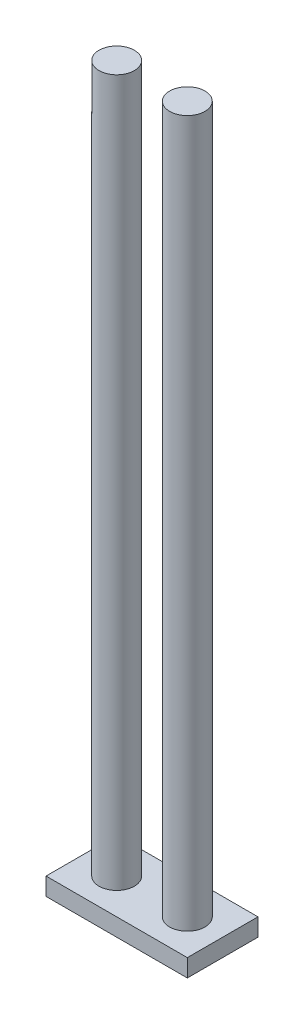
ISO-10303-21;
HEADER;
FILE_DESCRIPTION(('STEP AP214'),'2;1');
FILE_NAME('part.step','',(''),(''),'','','');
FILE_SCHEMA(('AUTOMOTIVE_DESIGN { 1 0 10303 214 1 1 1 1 }'));
ENDSEC;
DATA;
#1=APPLICATION_CONTEXT('core data for automotive mechanical design processes');
#2=APPLICATION_PROTOCOL_DEFINITION('international standard','automotive_design',2000,#1);
#3=PRODUCT_CONTEXT('',#1,'mechanical');
#4=PRODUCT('Part','Part','',(#3));
#5=PRODUCT_RELATED_PRODUCT_CATEGORY('part','',(#4));
#6=PRODUCT_DEFINITION_FORMATION('','',#4);
#7=PRODUCT_DEFINITION_CONTEXT('part definition',#1,'design');
#8=PRODUCT_DEFINITION('design','',#6,#7);
#9=PRODUCT_DEFINITION_SHAPE('','',#8);
#10=(LENGTH_UNIT() NAMED_UNIT(*) SI_UNIT(.MILLI.,.METRE.));
#11=(NAMED_UNIT(*) PLANE_ANGLE_UNIT() SI_UNIT($,.RADIAN.));
#12=(NAMED_UNIT(*) SI_UNIT($,.STERADIAN.) SOLID_ANGLE_UNIT());
#13=UNCERTAINTY_MEASURE_WITH_UNIT(LENGTH_MEASURE(1.E-05),#10,'distance_accuracy_value','');
#14=(GEOMETRIC_REPRESENTATION_CONTEXT(3) GLOBAL_UNCERTAINTY_ASSIGNED_CONTEXT((#13)) GLOBAL_UNIT_ASSIGNED_CONTEXT((#10,
#11,#12)) REPRESENTATION_CONTEXT('',''));
#15=CARTESIAN_POINT('',(0.,0.,0.));
#16=DIRECTION('',(0.,0.,1.));
#17=DIRECTION('',(1.,0.,0.));
#18=AXIS2_PLACEMENT_3D('',#15,#16,#17);
#19=CARTESIAN_POINT('',(0.,200.,0.));
#20=DIRECTION('',(0.,-1.,0.));
#21=DIRECTION('',(0.,0.,-1.));
#22=AXIS2_PLACEMENT_3D('',#19,#20,#21);
#23=CYLINDRICAL_SURFACE('',#22,5.);
#24=CARTESIAN_POINT('',(0.,200.,0.));
#25=DIRECTION('',(0.,1.,0.));
#26=DIRECTION('',(0.,0.,1.));
#27=AXIS2_PLACEMENT_3D('',#24,#25,#26);
#28=CIRCLE('',#27,5.);
#29=CARTESIAN_POINT('',(0.,200.,5.));
#30=VERTEX_POINT('',#29);
#31=EDGE_CURVE('E43',#30,#30,#28,.T.);
#32=ORIENTED_EDGE('',*,*,#31,.F.);
#33=EDGE_LOOP('',(#32));
#34=FACE_BOUND('',#33,.T.);
#35=CARTESIAN_POINT('',(0.,0.,0.));
#36=DIRECTION('',(0.,1.,0.));
#37=DIRECTION('',(0.,0.,1.));
#38=AXIS2_PLACEMENT_3D('',#35,#36,#37);
#39=CIRCLE('',#38,5.);
#40=CARTESIAN_POINT('',(0.,0.,5.));
#41=VERTEX_POINT('',#40);
#42=EDGE_CURVE('E113',#41,#41,#39,.T.);
#43=ORIENTED_EDGE('',*,*,#42,.T.);
#44=EDGE_LOOP('',(#43));
#45=FACE_BOUND('',#44,.T.);
#46=ADVANCED_FACE('F35',(#34,#45),#23,.T.);
#47=CARTESIAN_POINT('',(0.,200.,0.));
#48=DIRECTION('',(0.,1.,0.));
#49=DIRECTION('',(0.,0.,1.));
#50=AXIS2_PLACEMENT_3D('',#47,#48,#49);
#51=PLANE('',#50);
#52=ORIENTED_EDGE('',*,*,#31,.T.);
#53=EDGE_LOOP('',(#52));
#54=FACE_BOUND('',#53,.T.);
#55=ADVANCED_FACE('F136',(#54),#51,.T.);
#56=CARTESIAN_POINT('',(10.,-5.,10.));
#57=DIRECTION('',(1.,0.,0.));
#58=DIRECTION('',(0.,0.,-1.));
#59=AXIS2_PLACEMENT_3D('',#56,#57,#58);
#60=PLANE('',#59);
#61=DIRECTION('',(0.,0.,-1.));
#62=VECTOR('',#61,1.);
#63=CARTESIAN_POINT('',(10.,0.,10.));
#64=LINE('',#63,#62);
#65=CARTESIAN_POINT('',(10.,0.,10.));
#66=VERTEX_POINT('',#65);
#67=CARTESIAN_POINT('',(10.,0.,-10.));
#68=VERTEX_POINT('',#67);
#69=EDGE_CURVE('E103',#66,#68,#64,.T.);
#70=ORIENTED_EDGE('',*,*,#69,.F.);
#71=DIRECTION('',(0.,1.,0.));
#72=VECTOR('',#71,1.);
#73=CARTESIAN_POINT('',(10.,-5.,10.));
#74=LINE('',#73,#72);
#75=CARTESIAN_POINT('',(10.,-5.,10.));
#76=VERTEX_POINT('',#75);
#77=EDGE_CURVE('E51',#76,#66,#74,.T.);
#78=ORIENTED_EDGE('',*,*,#77,.F.);
#79=DIRECTION('',(0.,0.,-1.));
#80=VECTOR('',#79,1.);
#81=CARTESIAN_POINT('',(10.,-5.,10.));
#82=LINE('',#81,#80);
#83=CARTESIAN_POINT('',(10.,-5.,-10.));
#84=VERTEX_POINT('',#83);
#85=EDGE_CURVE('E96',#76,#84,#82,.T.);
#86=ORIENTED_EDGE('',*,*,#85,.T.);
#87=DIRECTION('',(0.,1.,0.));
#88=VECTOR('',#87,1.);
#89=CARTESIAN_POINT('',(10.,-5.,-10.));
#90=LINE('',#89,#88);
#91=EDGE_CURVE('E79',#84,#68,#90,.T.);
#92=ORIENTED_EDGE('',*,*,#91,.T.);
#93=EDGE_LOOP('',(#70,#78,#86,#92));
#94=FACE_BOUND('',#93,.T.);
#95=ADVANCED_FACE('F127',(#94),#60,.T.);
#96=CARTESIAN_POINT('',(-30.,-5.,10.));
#97=DIRECTION('',(0.,0.,1.));
#98=DIRECTION('',(1.,0.,0.));
#99=AXIS2_PLACEMENT_3D('',#96,#97,#98);
#100=PLANE('',#99);
#101=DIRECTION('',(1.,0.,0.));
#102=VECTOR('',#101,1.);
#103=CARTESIAN_POINT('',(-30.,0.,10.));
#104=LINE('',#103,#102);
#105=CARTESIAN_POINT('',(-30.,0.,10.));
#106=VERTEX_POINT('',#105);
#107=EDGE_CURVE('E98',#106,#66,#104,.T.);
#108=ORIENTED_EDGE('',*,*,#107,.F.);
#109=DIRECTION('',(0.,1.,0.));
#110=VECTOR('',#109,1.);
#111=CARTESIAN_POINT('',(-30.,-5.,10.));
#112=LINE('',#111,#110);
#113=CARTESIAN_POINT('',(-30.,-5.,10.));
#114=VERTEX_POINT('',#113);
#115=EDGE_CURVE('E68',#114,#106,#112,.T.);
#116=ORIENTED_EDGE('',*,*,#115,.F.);
#117=DIRECTION('',(1.,0.,0.));
#118=VECTOR('',#117,1.);
#119=CARTESIAN_POINT('',(-30.,-5.,10.));
#120=LINE('',#119,#118);
#121=EDGE_CURVE('E93',#114,#76,#120,.T.);
#122=ORIENTED_EDGE('',*,*,#121,.T.);
#123=ORIENTED_EDGE('',*,*,#77,.T.);
#124=EDGE_LOOP('',(#108,#116,#122,#123));
#125=FACE_BOUND('',#124,.T.);
#126=ADVANCED_FACE('F128',(#125),#100,.T.);
#127=CARTESIAN_POINT('',(-30.,-5.,10.));
#128=DIRECTION('',(-1.,0.,0.));
#129=DIRECTION('',(0.,0.,1.));
#130=AXIS2_PLACEMENT_3D('',#127,#128,#129);
#131=PLANE('',#130);
#132=DIRECTION('',(0.,0.,1.));
#133=VECTOR('',#132,1.);
#134=CARTESIAN_POINT('',(-30.,0.,10.));
#135=LINE('',#134,#133);
#136=CARTESIAN_POINT('',(-30.,0.,-10.));
#137=VERTEX_POINT('',#136);
#138=EDGE_CURVE('E87',#137,#106,#135,.T.);
#139=ORIENTED_EDGE('',*,*,#138,.F.);
#140=DIRECTION('',(0.,1.,0.));
#141=VECTOR('',#140,1.);
#142=CARTESIAN_POINT('',(-30.,-5.,-10.));
#143=LINE('',#142,#141);
#144=CARTESIAN_POINT('',(-30.,-5.,-10.));
#145=VERTEX_POINT('',#144);
#146=EDGE_CURVE('E82',#145,#137,#143,.T.);
#147=ORIENTED_EDGE('',*,*,#146,.F.);
#148=DIRECTION('',(0.,0.,1.));
#149=VECTOR('',#148,1.);
#150=CARTESIAN_POINT('',(-30.,-5.,10.));
#151=LINE('',#150,#149);
#152=EDGE_CURVE('E85',#145,#114,#151,.T.);
#153=ORIENTED_EDGE('',*,*,#152,.T.);
#154=ORIENTED_EDGE('',*,*,#115,.T.);
#155=EDGE_LOOP('',(#139,#147,#153,#154));
#156=FACE_BOUND('',#155,.T.);
#157=ADVANCED_FACE('F84',(#156),#131,.T.);
#158=CARTESIAN_POINT('',(-30.,-5.,-10.));
#159=DIRECTION('',(0.,0.,-1.));
#160=DIRECTION('',(-1.,0.,0.));
#161=AXIS2_PLACEMENT_3D('',#158,#159,#160);
#162=PLANE('',#161);
#163=DIRECTION('',(-1.,0.,0.));
#164=VECTOR('',#163,1.);
#165=CARTESIAN_POINT('',(-30.,0.,-10.));
#166=LINE('',#165,#164);
#167=EDGE_CURVE('E106',#68,#137,#166,.T.);
#168=ORIENTED_EDGE('',*,*,#167,.F.);
#169=ORIENTED_EDGE('',*,*,#91,.F.);
#170=DIRECTION('',(-1.,0.,0.));
#171=VECTOR('',#170,1.);
#172=CARTESIAN_POINT('',(-30.,-5.,-10.));
#173=LINE('',#172,#171);
#174=EDGE_CURVE('E92',#84,#145,#173,.T.);
#175=ORIENTED_EDGE('',*,*,#174,.T.);
#176=ORIENTED_EDGE('',*,*,#146,.T.);
#177=EDGE_LOOP('',(#168,#169,#175,#176));
#178=FACE_BOUND('',#177,.T.);
#179=ADVANCED_FACE('F95',(#178),#162,.T.);
#180=CARTESIAN_POINT('',(0.,-5.,0.));
#181=DIRECTION('',(0.,-1.,0.));
#182=DIRECTION('',(0.,0.,-1.));
#183=AXIS2_PLACEMENT_3D('',#180,#181,#182);
#184=PLANE('',#183);
#185=ORIENTED_EDGE('',*,*,#85,.F.);
#186=ORIENTED_EDGE('',*,*,#121,.F.);
#187=ORIENTED_EDGE('',*,*,#152,.F.);
#188=ORIENTED_EDGE('',*,*,#174,.F.);
#189=EDGE_LOOP('',(#185,#186,#187,#188));
#190=FACE_BOUND('',#189,.T.);
#191=ADVANCED_FACE('F91',(#190),#184,.T.);
#192=CARTESIAN_POINT('',(0.,0.,0.));
#193=DIRECTION('',(0.,-1.,0.));
#194=DIRECTION('',(0.,0.,-1.));
#195=AXIS2_PLACEMENT_3D('',#192,#193,#194);
#196=PLANE('',#195);
#197=CARTESIAN_POINT('',(-20.,0.,0.));
#198=DIRECTION('',(0.,-1.,0.));
#199=DIRECTION('',(0.,0.,-1.));
#200=AXIS2_PLACEMENT_3D('',#197,#198,#199);
#201=CIRCLE('',#200,5.);
#202=CARTESIAN_POINT('',(-20.,0.,-5.));
#203=VERTEX_POINT('',#202);
#204=EDGE_CURVE('E11',#203,#203,#201,.F.);
#205=ORIENTED_EDGE('',*,*,#204,.F.);
#206=EDGE_LOOP('',(#205));
#207=FACE_BOUND('',#206,.T.);
#208=ORIENTED_EDGE('',*,*,#42,.F.);
#209=EDGE_LOOP('',(#208));
#210=FACE_BOUND('',#209,.T.);
#211=ORIENTED_EDGE('',*,*,#69,.T.);
#212=ORIENTED_EDGE('',*,*,#167,.T.);
#213=ORIENTED_EDGE('',*,*,#138,.T.);
#214=ORIENTED_EDGE('',*,*,#107,.T.);
#215=EDGE_LOOP('',(#211,#212,#213,#214));
#216=FACE_BOUND('',#215,.T.);
#217=ADVANCED_FACE('F121',(#207,#210,#216),#196,.F.);
#218=CARTESIAN_POINT('',(-20.,200.,0.));
#219=DIRECTION('',(0.,-1.,0.));
#220=DIRECTION('',(0.,0.,-1.));
#221=AXIS2_PLACEMENT_3D('',#218,#219,#220);
#222=CYLINDRICAL_SURFACE('',#221,5.);
#223=CARTESIAN_POINT('',(-20.,200.,0.));
#224=DIRECTION('',(0.,1.,0.));
#225=DIRECTION('',(0.,0.,1.));
#226=AXIS2_PLACEMENT_3D('',#223,#224,#225);
#227=CIRCLE('',#226,5.);
#228=CARTESIAN_POINT('',(-20.,200.,5.));
#229=VERTEX_POINT('',#228);
#230=EDGE_CURVE('E107',#229,#229,#227,.T.);
#231=ORIENTED_EDGE('',*,*,#230,.F.);
#232=EDGE_LOOP('',(#231));
#233=FACE_BOUND('',#232,.T.);
#234=ORIENTED_EDGE('',*,*,#204,.T.);
#235=EDGE_LOOP('',(#234));
#236=FACE_BOUND('',#235,.T.);
#237=ADVANCED_FACE('F124',(#233,#236),#222,.T.);
#238=CARTESIAN_POINT('',(-20.,200.,0.));
#239=DIRECTION('',(0.,1.,0.));
#240=DIRECTION('',(0.,0.,1.));
#241=AXIS2_PLACEMENT_3D('',#238,#239,#240);
#242=PLANE('',#241);
#243=ORIENTED_EDGE('',*,*,#230,.T.);
#244=EDGE_LOOP('',(#243));
#245=FACE_BOUND('',#244,.T.);
#246=ADVANCED_FACE('F158',(#245),#242,.T.);
#247=CLOSED_SHELL('',(#46,#55,#95,#126,#157,#179,#191,#217,#237,#246));
#248=MANIFOLD_SOLID_BREP('B2',#247);
#249=ADVANCED_BREP_SHAPE_REPRESENTATION('',(#18,#248),#14);
#250=SHAPE_DEFINITION_REPRESENTATION(#9,#249);
ENDSEC;
END-ISO-10303-21;
